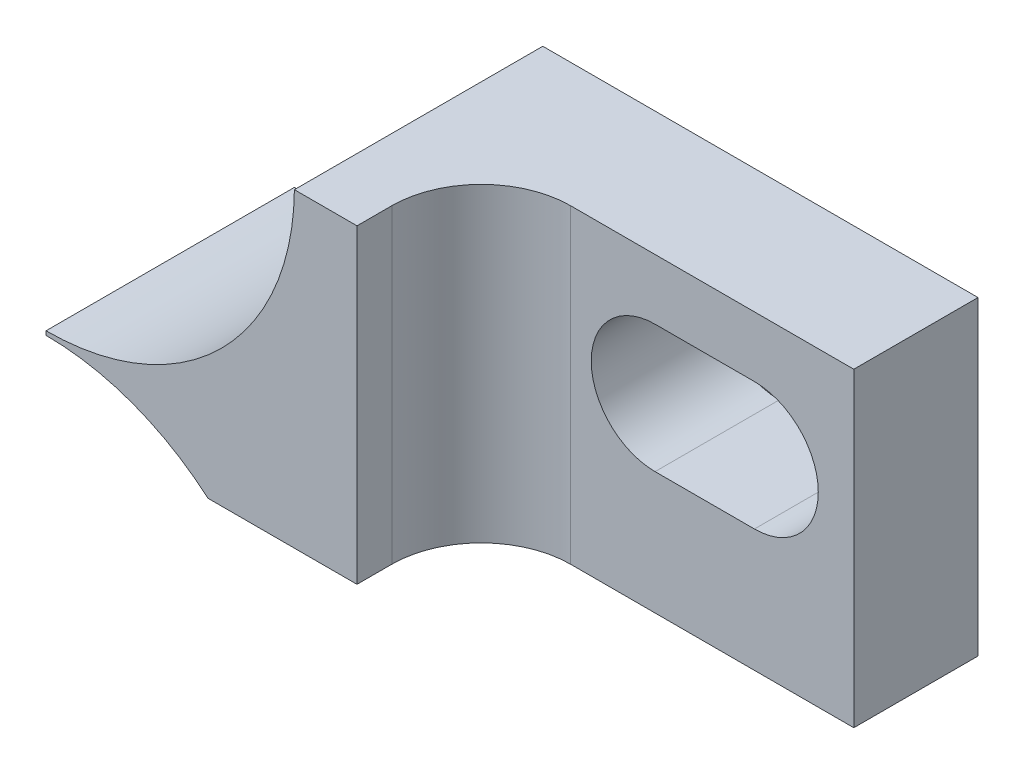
from build123d import *

# Parameters (mm, degrees)
SKETCH1_R           = 1.63195
EXTRUDE1_DEPTH      = 6.35
SKETCH5_W           = 15.98667914
SKETCH5_H           = 1.5875
CUT_EXTRUDE4_DEPTH  = 116.178567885
SKETCH6_W           = 6.35
SKETCH6_H           = 3.175
CUT_EXTRUDE5_DEPTH  = 116.178567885
CUT_EXTRUDE6_DEPTH  = 115.75110634
CUT_EXTRUDE7_DEPTH  = 115.871833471
SKETCH9_R           = 1.63195
CUT_EXTRUDE8_DEPTH  = 6.35
EXTRUDE2_DEPTH      = 2.54
EXTRUDE2_DEPTH_BACK = 116.178567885
SKETCH10_W          = 104.383265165
SKETCH10_H          = 41.601620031


with BuildPart() as part:
    # Sketch1 → Extrude1 (new body)
    with BuildSketch(Plane.XY):
        with BuildLine():
            Line((0, 9.525), (0, 0))
            Line((0, 0), (7.950403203, 0))
            ThreePointArc((7.950403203, 0), (12.65282779, 6.081790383), (19.769817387, 3.175))
            Line((19.769817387, 3.175), (91.355182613, 3.175))
            ThreePointArc((91.355182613, 3.175), (96.8248, 6.2992), (102.294417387, 3.175))
            Line((102.294417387, 3.175), (114.3, 3.175))
            Line((114.3, 3.175), (114.3, 12.7))
            Line((114.3, 12.7), (103.174596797, 12.7))
            ThreePointArc((103.174596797, 12.7), (98.47217221, 6.618209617), (91.355182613, 9.525))
            Line((91.355182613, 9.525), (19.769817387, 9.525))
            ThreePointArc((19.769817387, 9.525), (14.3002, 6.4008), (8.830582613, 9.525))
            Line((8.830582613, 9.525), (0, 9.525))
        make_face()
        with BuildLine():
            Line((109.22, 11.15695), (111.76, 11.15695))
            ThreePointArc((111.76, 11.15695), (113.39195, 9.525), (111.76, 7.89305))
            Line((111.76, 7.89305), (109.22, 7.89305))
            ThreePointArc((109.22, 7.89305), (107.58805, 9.525), (109.22, 11.15695))
        make_face(mode=Mode.SUBTRACT)
        with Locations(Location((3.175, 3.175, 0), (0, 0, 180))):
            Circle(SKETCH1_R, mode=Mode.SUBTRACT)
    extrude(amount=EXTRUDE1_DEPTH)

    # Sketch5 → Cut-Extrude4 (cut, through all)
    with BuildSketch(Plane(origin=(0, 0, 0), x_dir=(-1, 0, 0), z_dir=(0, 0, -1))):
        with Locations((-106.30666043, 3.96875)):
            Rectangle(SKETCH5_W, SKETCH5_H)
    extrude(amount=-CUT_EXTRUDE4_DEPTH, mode=Mode.SUBTRACT)

    # Sketch6 → Cut-Extrude5 (cut, through all)
    with BuildSketch(Plane.XZ):
        with Locations((3.175, 4.7625)):
            Rectangle(SKETCH6_W, SKETCH6_H)
    extrude(amount=-CUT_EXTRUDE5_DEPTH, mode=Mode.SUBTRACT)

    # Sketch7 → Cut-Extrude6 (cut, through all)
    with BuildSketch(Plane.XZ.offset(-4.7625)):
        with BuildLine():
            Line((114.3, 6.35), (104.775, 6.35))
            Line((104.775, 6.35), (104.775, 5.461))
            ThreePointArc((104.775, 5.461), (105.444553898, 3.844553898), (107.061, 3.175))
            Line((107.061, 3.175), (114.3, 3.175))
            Line((114.3, 3.175), (114.3, 6.35))
        make_face()
    extrude(amount=-CUT_EXTRUDE6_DEPTH, mode=Mode.SUBTRACT)

    # Sketch8 → Cut-Extrude7 (cut, through all)
    with BuildSketch(Plane.XZ.offset(-3.175)):
        with BuildLine():
            Line((25.4, 6.35), (25.4, 3.556))
            ThreePointArc((25.4, 3.556), (25.848403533, 5.182744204), (27.066958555, 6.35))
            Line((27.066958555, 6.35), (25.4, 6.35))
        make_face()
        with BuildLine():
            Line((31.75, 3.556), (31.75, 6.35))
            Line((31.75, 6.35), (30.083041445, 6.35))
            ThreePointArc((30.083041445, 6.35), (31.301596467, 5.182744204), (31.75, 3.556))
        make_face()
        with BuildLine():
            Line((25.4, 3.556), (31.75, 3.556))
            ThreePointArc((31.75, 3.556), (31.301596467, 5.182744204), (30.083041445, 6.35))
            Line((30.083041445, 6.35), (27.066958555, 6.35))
            ThreePointArc((27.066958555, 6.35), (25.848403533, 5.182744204), (25.4, 3.556))
        make_face()
        with BuildLine():
            ThreePointArc((25.4, 3.556), (28.575, 0.381), (31.75, 3.556))
            Line((31.75, 3.556), (25.4, 3.556))
        make_face()
        with BuildLine():
            Line((79.375, 6.35), (79.375, 3.556))
            ThreePointArc((79.375, 3.556), (79.823403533, 5.182744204), (81.041958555, 6.35))
            Line((81.041958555, 6.35), (79.375, 6.35))
        make_face()
        with BuildLine():
            Line((79.375, 3.556), (85.725, 3.556))
            ThreePointArc((85.725, 3.556), (85.276596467, 5.182744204), (84.058041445, 6.35))
            Line((84.058041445, 6.35), (81.041958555, 6.35))
            ThreePointArc((81.041958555, 6.35), (79.823403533, 5.182744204), (79.375, 3.556))
        make_face()
        with BuildLine():
            ThreePointArc((84.058041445, 6.35), (85.276596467, 5.182744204), (85.725, 3.556))
            Line((85.725, 3.556), (85.725, 6.35))
            Line((85.725, 6.35), (84.058041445, 6.35))
        make_face()
        with BuildLine():
            ThreePointArc((79.375, 3.556), (82.55, 0.381), (85.725, 3.556))
            Line((85.725, 3.556), (79.375, 3.556))
        make_face()
    extrude(amount=-CUT_EXTRUDE7_DEPTH, mode=Mode.SUBTRACT)

    # Sketch9 → Cut-Extrude8 (cut)
    with BuildSketch(Plane.XY.offset(6.35)):
        with Locations((39.37, 6.35)):
            Circle(SKETCH9_R)
        with Locations((74.93, 6.35)):
            Circle(SKETCH9_R)
    extrude(amount=-CUT_EXTRUDE8_DEPTH, mode=Mode.SUBTRACT)

    # Sketch10 → Extrude2 (cut, two sides: drawn at the far end of the back side and taken through both)
    with BuildSketch(Plane.XY.offset(6.35).offset(-EXTRUDE2_DEPTH_BACK)):
        with Locations((44.633167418, -0.816524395)):
            Rectangle(SKETCH10_W, SKETCH10_H)
    extrude(amount=EXTRUDE2_DEPTH + EXTRUDE2_DEPTH_BACK, mode=Mode.SUBTRACT)


solid = part.part
